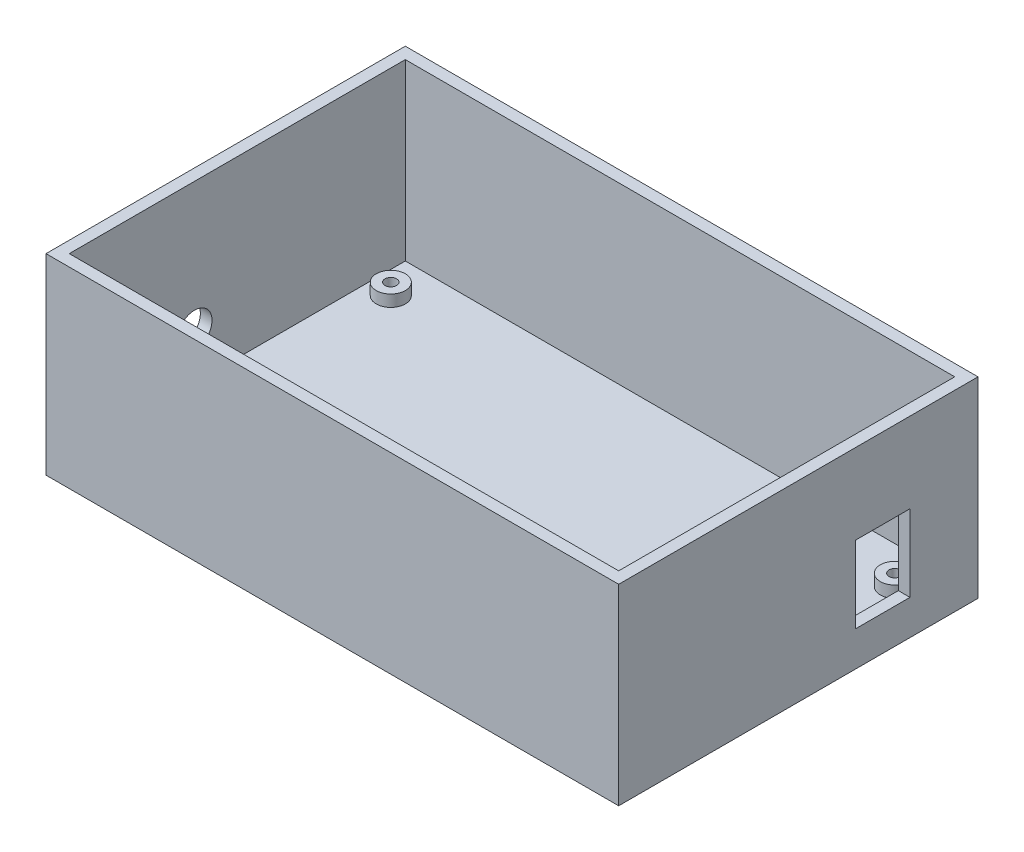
ISO-10303-21;
HEADER;
FILE_DESCRIPTION(('STEP AP214'),'2;1');
FILE_NAME('part.step','',(''),(''),'','','');
FILE_SCHEMA(('AUTOMOTIVE_DESIGN { 1 0 10303 214 1 1 1 1 }'));
ENDSEC;
DATA;
#1=APPLICATION_CONTEXT('core data for automotive mechanical design processes');
#2=APPLICATION_PROTOCOL_DEFINITION('international standard','automotive_design',2000,#1);
#3=PRODUCT_CONTEXT('',#1,'mechanical');
#4=PRODUCT('Part','Part','',(#3));
#5=PRODUCT_RELATED_PRODUCT_CATEGORY('part','',(#4));
#6=PRODUCT_DEFINITION_FORMATION('','',#4);
#7=PRODUCT_DEFINITION_CONTEXT('part definition',#1,'design');
#8=PRODUCT_DEFINITION('design','',#6,#7);
#9=PRODUCT_DEFINITION_SHAPE('','',#8);
#10=(LENGTH_UNIT() NAMED_UNIT(*) SI_UNIT(.MILLI.,.METRE.));
#11=(NAMED_UNIT(*) PLANE_ANGLE_UNIT() SI_UNIT($,.RADIAN.));
#12=(NAMED_UNIT(*) SI_UNIT($,.STERADIAN.) SOLID_ANGLE_UNIT());
#13=UNCERTAINTY_MEASURE_WITH_UNIT(LENGTH_MEASURE(1.E-05),#10,'distance_accuracy_value','');
#14=(GEOMETRIC_REPRESENTATION_CONTEXT(3) GLOBAL_UNCERTAINTY_ASSIGNED_CONTEXT((#13)) GLOBAL_UNIT_ASSIGNED_CONTEXT((#10,
#11,#12)) REPRESENTATION_CONTEXT('',''));
#15=CARTESIAN_POINT('',(0.,0.,0.));
#16=DIRECTION('',(0.,0.,1.));
#17=DIRECTION('',(1.,0.,0.));
#18=AXIS2_PLACEMENT_3D('',#15,#16,#17);
#19=CARTESIAN_POINT('',(0.,-2.,0.));
#20=DIRECTION('',(0.,-1.,0.));
#21=DIRECTION('',(0.,0.,-1.));
#22=AXIS2_PLACEMENT_3D('',#19,#20,#21);
#23=PLANE('',#22);
#24=DIRECTION('',(0.,0.,-1.));
#25=VECTOR('',#24,1.);
#26=CARTESIAN_POINT('',(47.25,-2.,28.85));
#27=LINE('',#26,#25);
#28=CARTESIAN_POINT('',(47.25,-2.,28.85));
#29=VERTEX_POINT('',#28);
#30=CARTESIAN_POINT('',(47.25,-2.,-28.95));
#31=VERTEX_POINT('',#30);
#32=EDGE_CURVE('E167',#29,#31,#27,.T.);
#33=ORIENTED_EDGE('',*,*,#32,.T.);
#34=DIRECTION('',(-1.,0.,0.));
#35=VECTOR('',#34,1.);
#36=CARTESIAN_POINT('',(47.25,-2.,-28.95));
#37=LINE('',#36,#35);
#38=CARTESIAN_POINT('',(-47.25,-2.,-28.95));
#39=VERTEX_POINT('',#38);
#40=EDGE_CURVE('E160',#31,#39,#37,.T.);
#41=ORIENTED_EDGE('',*,*,#40,.T.);
#42=DIRECTION('',(0.,0.,1.));
#43=VECTOR('',#42,1.);
#44=CARTESIAN_POINT('',(-47.25,-2.,-28.95));
#45=LINE('',#44,#43);
#46=CARTESIAN_POINT('',(-47.25,-2.,28.85));
#47=VERTEX_POINT('',#46);
#48=EDGE_CURVE('E177',#39,#47,#45,.T.);
#49=ORIENTED_EDGE('',*,*,#48,.T.);
#50=DIRECTION('',(1.,0.,0.));
#51=VECTOR('',#50,1.);
#52=CARTESIAN_POINT('',(-47.25,-2.,28.85));
#53=LINE('',#52,#51);
#54=EDGE_CURVE('E180',#47,#29,#53,.T.);
#55=ORIENTED_EDGE('',*,*,#54,.T.);
#56=EDGE_LOOP('',(#33,#41,#49,#55));
#57=FACE_BOUND('',#56,.T.);
#58=CARTESIAN_POINT('',(43.35,-2.,-22.55));
#59=DIRECTION('',(0.,-1.,0.));
#60=DIRECTION('',(0.,0.,-1.));
#61=AXIS2_PLACEMENT_3D('',#58,#59,#60);
#62=CIRCLE('',#61,2.5);
#63=CARTESIAN_POINT('',(43.35,-2.,-25.05));
#64=VERTEX_POINT('',#63);
#65=EDGE_CURVE('E11',#64,#64,#62,.F.);
#66=ORIENTED_EDGE('',*,*,#65,.F.);
#67=EDGE_LOOP('',(#66));
#68=FACE_BOUND('',#67,.T.);
#69=CARTESIAN_POINT('',(43.35,-2.,22.55));
#70=DIRECTION('',(0.,-1.,0.));
#71=DIRECTION('',(0.,0.,-1.));
#72=AXIS2_PLACEMENT_3D('',#69,#70,#71);
#73=CIRCLE('',#72,2.5);
#74=CARTESIAN_POINT('',(43.35,-2.,20.05));
#75=VERTEX_POINT('',#74);
#76=EDGE_CURVE('E42',#75,#75,#73,.F.);
#77=ORIENTED_EDGE('',*,*,#76,.F.);
#78=EDGE_LOOP('',(#77));
#79=FACE_BOUND('',#78,.T.);
#80=CARTESIAN_POINT('',(-43.35,-2.,22.55));
#81=DIRECTION('',(0.,-1.,0.));
#82=DIRECTION('',(0.,0.,-1.));
#83=AXIS2_PLACEMENT_3D('',#80,#81,#82);
#84=CIRCLE('',#83,2.5);
#85=CARTESIAN_POINT('',(-43.35,-2.,20.05));
#86=VERTEX_POINT('',#85);
#87=EDGE_CURVE('E240',#86,#86,#84,.F.);
#88=ORIENTED_EDGE('',*,*,#87,.F.);
#89=EDGE_LOOP('',(#88));
#90=FACE_BOUND('',#89,.T.);
#91=CARTESIAN_POINT('',(-43.35,-2.,-22.55));
#92=DIRECTION('',(0.,-1.,0.));
#93=DIRECTION('',(0.,0.,-1.));
#94=AXIS2_PLACEMENT_3D('',#91,#92,#93);
#95=CIRCLE('',#94,2.5);
#96=CARTESIAN_POINT('',(-43.35,-2.,-25.05));
#97=VERTEX_POINT('',#96);
#98=EDGE_CURVE('E232',#97,#97,#95,.F.);
#99=ORIENTED_EDGE('',*,*,#98,.F.);
#100=EDGE_LOOP('',(#99));
#101=FACE_BOUND('',#100,.T.);
#102=ADVANCED_FACE('F34',(#57,#68,#79,#90,#101),#23,.F.);
#103=CARTESIAN_POINT('',(-43.35,0.,-22.55));
#104=DIRECTION('',(0.,-1.,0.));
#105=DIRECTION('',(0.,0.,-1.));
#106=AXIS2_PLACEMENT_3D('',#103,#104,#105);
#107=CYLINDRICAL_SURFACE('',#106,2.5);
#108=CARTESIAN_POINT('',(-43.35,0.,-22.55));
#109=DIRECTION('',(0.,1.,0.));
#110=DIRECTION('',(0.,0.,1.));
#111=AXIS2_PLACEMENT_3D('',#108,#109,#110);
#112=CIRCLE('',#111,2.5);
#113=CARTESIAN_POINT('',(-43.35,0.,-20.05));
#114=VERTEX_POINT('',#113);
#115=EDGE_CURVE('E214',#114,#114,#112,.T.);
#116=ORIENTED_EDGE('',*,*,#115,.F.);
#117=EDGE_LOOP('',(#116));
#118=FACE_BOUND('',#117,.T.);
#119=ORIENTED_EDGE('',*,*,#98,.T.);
#120=EDGE_LOOP('',(#119));
#121=FACE_BOUND('',#120,.T.);
#122=ADVANCED_FACE('F249',(#118,#121),#107,.T.);
#123=CARTESIAN_POINT('',(-43.35,0.,-22.55));
#124=DIRECTION('',(0.,1.,0.));
#125=DIRECTION('',(0.,0.,1.));
#126=AXIS2_PLACEMENT_3D('',#123,#124,#125);
#127=PLANE('',#126);
#128=CARTESIAN_POINT('',(-43.35,0.,-22.55));
#129=DIRECTION('',(0.,1.,0.));
#130=DIRECTION('',(0.,0.,1.));
#131=AXIS2_PLACEMENT_3D('',#128,#129,#130);
#132=CIRCLE('',#131,0.999999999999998);
#133=CARTESIAN_POINT('',(-43.35,0.,-21.55));
#134=VERTEX_POINT('',#133);
#135=EDGE_CURVE('E622',#134,#134,#132,.T.);
#136=ORIENTED_EDGE('',*,*,#135,.F.);
#137=EDGE_LOOP('',(#136));
#138=FACE_BOUND('',#137,.T.);
#139=ORIENTED_EDGE('',*,*,#115,.T.);
#140=EDGE_LOOP('',(#139));
#141=FACE_BOUND('',#140,.T.);
#142=ADVANCED_FACE('F257',(#138,#141),#127,.T.);
#143=CARTESIAN_POINT('',(-43.35,0.,22.55));
#144=DIRECTION('',(0.,-1.,0.));
#145=DIRECTION('',(0.,0.,-1.));
#146=AXIS2_PLACEMENT_3D('',#143,#144,#145);
#147=CYLINDRICAL_SURFACE('',#146,2.5);
#148=CARTESIAN_POINT('',(-43.35,0.,22.55));
#149=DIRECTION('',(0.,1.,0.));
#150=DIRECTION('',(0.,0.,1.));
#151=AXIS2_PLACEMENT_3D('',#148,#149,#150);
#152=CIRCLE('',#151,2.5);
#153=CARTESIAN_POINT('',(-43.35,0.,25.05));
#154=VERTEX_POINT('',#153);
#155=EDGE_CURVE('E211',#154,#154,#152,.T.);
#156=ORIENTED_EDGE('',*,*,#155,.F.);
#157=EDGE_LOOP('',(#156));
#158=FACE_BOUND('',#157,.T.);
#159=ORIENTED_EDGE('',*,*,#87,.T.);
#160=EDGE_LOOP('',(#159));
#161=FACE_BOUND('',#160,.T.);
#162=ADVANCED_FACE('F263',(#158,#161),#147,.T.);
#163=CARTESIAN_POINT('',(-43.35,0.,22.55));
#164=DIRECTION('',(0.,1.,0.));
#165=DIRECTION('',(0.,0.,1.));
#166=AXIS2_PLACEMENT_3D('',#163,#164,#165);
#167=PLANE('',#166);
#168=CARTESIAN_POINT('',(-43.35,0.,22.55));
#169=DIRECTION('',(0.,1.,0.));
#170=DIRECTION('',(0.,0.,1.));
#171=AXIS2_PLACEMENT_3D('',#168,#169,#170);
#172=CIRCLE('',#171,0.999999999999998);
#173=CARTESIAN_POINT('',(-43.35,0.,23.55));
#174=VERTEX_POINT('',#173);
#175=EDGE_CURVE('E616',#174,#174,#172,.T.);
#176=ORIENTED_EDGE('',*,*,#175,.F.);
#177=EDGE_LOOP('',(#176));
#178=FACE_BOUND('',#177,.T.);
#179=ORIENTED_EDGE('',*,*,#155,.T.);
#180=EDGE_LOOP('',(#179));
#181=FACE_BOUND('',#180,.T.);
#182=ADVANCED_FACE('F347',(#178,#181),#167,.T.);
#183=CARTESIAN_POINT('',(43.35,0.,22.55));
#184=DIRECTION('',(0.,-1.,0.));
#185=DIRECTION('',(0.,0.,-1.));
#186=AXIS2_PLACEMENT_3D('',#183,#184,#185);
#187=CYLINDRICAL_SURFACE('',#186,2.5);
#188=CARTESIAN_POINT('',(43.35,0.,22.55));
#189=DIRECTION('',(0.,1.,0.));
#190=DIRECTION('',(0.,0.,1.));
#191=AXIS2_PLACEMENT_3D('',#188,#189,#190);
#192=CIRCLE('',#191,2.5);
#193=CARTESIAN_POINT('',(43.35,0.,25.05));
#194=VERTEX_POINT('',#193);
#195=EDGE_CURVE('E208',#194,#194,#192,.T.);
#196=ORIENTED_EDGE('',*,*,#195,.F.);
#197=EDGE_LOOP('',(#196));
#198=FACE_BOUND('',#197,.T.);
#199=ORIENTED_EDGE('',*,*,#76,.T.);
#200=EDGE_LOOP('',(#199));
#201=FACE_BOUND('',#200,.T.);
#202=ADVANCED_FACE('F245',(#198,#201),#187,.T.);
#203=CARTESIAN_POINT('',(43.35,0.,22.55));
#204=DIRECTION('',(0.,1.,0.));
#205=DIRECTION('',(0.,0.,1.));
#206=AXIS2_PLACEMENT_3D('',#203,#204,#205);
#207=PLANE('',#206);
#208=CARTESIAN_POINT('',(43.35,0.,22.55));
#209=DIRECTION('',(0.,1.,0.));
#210=DIRECTION('',(0.,0.,1.));
#211=AXIS2_PLACEMENT_3D('',#208,#209,#210);
#212=CIRCLE('',#211,0.999999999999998);
#213=CARTESIAN_POINT('',(43.35,0.,23.55));
#214=VERTEX_POINT('',#213);
#215=EDGE_CURVE('E604',#214,#214,#212,.T.);
#216=ORIENTED_EDGE('',*,*,#215,.F.);
#217=EDGE_LOOP('',(#216));
#218=FACE_BOUND('',#217,.T.);
#219=ORIENTED_EDGE('',*,*,#195,.T.);
#220=EDGE_LOOP('',(#219));
#221=FACE_BOUND('',#220,.T.);
#222=ADVANCED_FACE('F340',(#218,#221),#207,.T.);
#223=CARTESIAN_POINT('',(43.35,0.,-22.55));
#224=DIRECTION('',(0.,-1.,0.));
#225=DIRECTION('',(0.,0.,-1.));
#226=AXIS2_PLACEMENT_3D('',#223,#224,#225);
#227=CYLINDRICAL_SURFACE('',#226,2.5);
#228=CARTESIAN_POINT('',(43.35,0.,-22.55));
#229=DIRECTION('',(0.,1.,0.));
#230=DIRECTION('',(0.,0.,1.));
#231=AXIS2_PLACEMENT_3D('',#228,#229,#230);
#232=CIRCLE('',#231,2.5);
#233=CARTESIAN_POINT('',(43.35,0.,-20.05));
#234=VERTEX_POINT('',#233);
#235=EDGE_CURVE('E205',#234,#234,#232,.T.);
#236=ORIENTED_EDGE('',*,*,#235,.F.);
#237=EDGE_LOOP('',(#236));
#238=FACE_BOUND('',#237,.T.);
#239=ORIENTED_EDGE('',*,*,#65,.T.);
#240=EDGE_LOOP('',(#239));
#241=FACE_BOUND('',#240,.T.);
#242=ADVANCED_FACE('F336',(#238,#241),#227,.T.);
#243=CARTESIAN_POINT('',(43.35,0.,-22.55));
#244=DIRECTION('',(0.,1.,0.));
#245=DIRECTION('',(0.,0.,1.));
#246=AXIS2_PLACEMENT_3D('',#243,#244,#245);
#247=PLANE('',#246);
#248=CARTESIAN_POINT('',(43.35,0.,-22.55));
#249=DIRECTION('',(0.,1.,0.));
#250=DIRECTION('',(0.,0.,1.));
#251=AXIS2_PLACEMENT_3D('',#248,#249,#250);
#252=CIRCLE('',#251,0.999999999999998);
#253=CARTESIAN_POINT('',(43.35,0.,-21.55));
#254=VERTEX_POINT('',#253);
#255=EDGE_CURVE('E147',#254,#254,#252,.T.);
#256=ORIENTED_EDGE('',*,*,#255,.F.);
#257=EDGE_LOOP('',(#256));
#258=FACE_BOUND('',#257,.T.);
#259=ORIENTED_EDGE('',*,*,#235,.T.);
#260=EDGE_LOOP('',(#259));
#261=FACE_BOUND('',#260,.T.);
#262=ADVANCED_FACE('F302',(#258,#261),#247,.T.);
#263=CARTESIAN_POINT('',(0.,28.,0.));
#264=DIRECTION('',(0.,1.,0.));
#265=DIRECTION('',(0.,0.,1.));
#266=AXIS2_PLACEMENT_3D('',#263,#264,#265);
#267=PLANE('',#266);
#268=DIRECTION('',(1.,0.,0.));
#269=VECTOR('',#268,1.);
#270=CARTESIAN_POINT('',(-49.25,28.,30.85));
#271=LINE('',#270,#269);
#272=CARTESIAN_POINT('',(-49.25,28.,30.85));
#273=VERTEX_POINT('',#272);
#274=CARTESIAN_POINT('',(49.25,28.,30.85));
#275=VERTEX_POINT('',#274);
#276=EDGE_CURVE('E193',#273,#275,#271,.T.);
#277=ORIENTED_EDGE('',*,*,#276,.T.);
#278=DIRECTION('',(0.,0.,-1.));
#279=VECTOR('',#278,1.);
#280=CARTESIAN_POINT('',(49.25,28.,30.85));
#281=LINE('',#280,#279);
#282=CARTESIAN_POINT('',(49.25,28.,-30.95));
#283=VERTEX_POINT('',#282);
#284=EDGE_CURVE('E196',#275,#283,#281,.T.);
#285=ORIENTED_EDGE('',*,*,#284,.T.);
#286=DIRECTION('',(-1.,0.,0.));
#287=VECTOR('',#286,1.);
#288=CARTESIAN_POINT('',(49.25,28.,-30.95));
#289=LINE('',#288,#287);
#290=CARTESIAN_POINT('',(-49.25,28.,-30.95));
#291=VERTEX_POINT('',#290);
#292=EDGE_CURVE('E199',#283,#291,#289,.T.);
#293=ORIENTED_EDGE('',*,*,#292,.T.);
#294=DIRECTION('',(0.,0.,1.));
#295=VECTOR('',#294,1.);
#296=CARTESIAN_POINT('',(-49.25,28.,-30.95));
#297=LINE('',#296,#295);
#298=EDGE_CURVE('E202',#291,#273,#297,.T.);
#299=ORIENTED_EDGE('',*,*,#298,.T.);
#300=EDGE_LOOP('',(#277,#285,#293,#299));
#301=FACE_BOUND('',#300,.T.);
#302=DIRECTION('',(0.,0.,1.));
#303=VECTOR('',#302,1.);
#304=CARTESIAN_POINT('',(-47.25,28.,-28.95));
#305=LINE('',#304,#303);
#306=CARTESIAN_POINT('',(-47.25,28.,-28.95));
#307=VERTEX_POINT('',#306);
#308=CARTESIAN_POINT('',(-47.25,28.,28.85));
#309=VERTEX_POINT('',#308);
#310=EDGE_CURVE('E166',#307,#309,#305,.T.);
#311=ORIENTED_EDGE('',*,*,#310,.F.);
#312=DIRECTION('',(-1.,0.,0.));
#313=VECTOR('',#312,1.);
#314=CARTESIAN_POINT('',(47.25,28.,-28.95));
#315=LINE('',#314,#313);
#316=CARTESIAN_POINT('',(47.25,28.,-28.95));
#317=VERTEX_POINT('',#316);
#318=EDGE_CURVE('E164',#317,#307,#315,.T.);
#319=ORIENTED_EDGE('',*,*,#318,.F.);
#320=DIRECTION('',(0.,0.,-1.));
#321=VECTOR('',#320,1.);
#322=CARTESIAN_POINT('',(47.25,28.,28.85));
#323=LINE('',#322,#321);
#324=CARTESIAN_POINT('',(47.25,28.,28.85));
#325=VERTEX_POINT('',#324);
#326=EDGE_CURVE('E172',#325,#317,#323,.T.);
#327=ORIENTED_EDGE('',*,*,#326,.F.);
#328=DIRECTION('',(1.,0.,0.));
#329=VECTOR('',#328,1.);
#330=CARTESIAN_POINT('',(-47.25,28.,28.85));
#331=LINE('',#330,#329);
#332=EDGE_CURVE('E169',#309,#325,#331,.T.);
#333=ORIENTED_EDGE('',*,*,#332,.F.);
#334=EDGE_LOOP('',(#311,#319,#327,#333));
#335=FACE_BOUND('',#334,.T.);
#336=ADVANCED_FACE('F296',(#301,#335),#267,.T.);
#337=CARTESIAN_POINT('',(47.25,28.,-28.95));
#338=DIRECTION('',(0.,0.,1.));
#339=DIRECTION('',(1.,0.,0.));
#340=AXIS2_PLACEMENT_3D('',#337,#338,#339);
#341=PLANE('',#340);
#342=ORIENTED_EDGE('',*,*,#40,.F.);
#343=DIRECTION('',(0.,-1.,0.));
#344=VECTOR('',#343,1.);
#345=CARTESIAN_POINT('',(47.25,28.,-28.95));
#346=LINE('',#345,#344);
#347=EDGE_CURVE('E174',#317,#31,#346,.T.);
#348=ORIENTED_EDGE('',*,*,#347,.F.);
#349=ORIENTED_EDGE('',*,*,#318,.T.);
#350=DIRECTION('',(0.,-1.,0.));
#351=VECTOR('',#350,1.);
#352=CARTESIAN_POINT('',(-47.25,28.,-28.95));
#353=LINE('',#352,#351);
#354=EDGE_CURVE('E190',#307,#39,#353,.T.);
#355=ORIENTED_EDGE('',*,*,#354,.T.);
#356=EDGE_LOOP('',(#342,#348,#349,#355));
#357=FACE_BOUND('',#356,.T.);
#358=ADVANCED_FACE('F301',(#357),#341,.T.);
#359=CARTESIAN_POINT('',(-47.25,28.,-28.95));
#360=DIRECTION('',(1.,0.,0.));
#361=DIRECTION('',(0.,0.,-1.));
#362=AXIS2_PLACEMENT_3D('',#359,#360,#361);
#363=PLANE('',#362);
#364=CARTESIAN_POINT('',(-47.25,5.8,7.29999999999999));
#365=DIRECTION('',(1.,0.,0.));
#366=DIRECTION('',(0.,0.,-1.));
#367=AXIS2_PLACEMENT_3D('',#364,#365,#366);
#368=CIRCLE('',#367,3.);
#369=CARTESIAN_POINT('',(-47.25,5.8,4.29999999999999));
#370=VERTEX_POINT('',#369);
#371=EDGE_CURVE('E611',#370,#370,#368,.T.);
#372=ORIENTED_EDGE('',*,*,#371,.F.);
#373=EDGE_LOOP('',(#372));
#374=FACE_BOUND('',#373,.T.);
#375=ORIENTED_EDGE('',*,*,#48,.F.);
#376=ORIENTED_EDGE('',*,*,#354,.F.);
#377=ORIENTED_EDGE('',*,*,#310,.T.);
#378=DIRECTION('',(0.,-1.,0.));
#379=VECTOR('',#378,1.);
#380=CARTESIAN_POINT('',(-47.25,28.,28.85));
#381=LINE('',#380,#379);
#382=EDGE_CURVE('E188',#309,#47,#381,.T.);
#383=ORIENTED_EDGE('',*,*,#382,.T.);
#384=EDGE_LOOP('',(#375,#376,#377,#383));
#385=FACE_BOUND('',#384,.T.);
#386=ADVANCED_FACE('F311',(#374,#385),#363,.T.);
#387=CARTESIAN_POINT('',(-47.25,28.,28.85));
#388=DIRECTION('',(0.,0.,-1.));
#389=DIRECTION('',(-1.,0.,0.));
#390=AXIS2_PLACEMENT_3D('',#387,#388,#389);
#391=PLANE('',#390);
#392=ORIENTED_EDGE('',*,*,#54,.F.);
#393=ORIENTED_EDGE('',*,*,#382,.F.);
#394=ORIENTED_EDGE('',*,*,#332,.T.);
#395=DIRECTION('',(0.,-1.,0.));
#396=VECTOR('',#395,1.);
#397=CARTESIAN_POINT('',(47.25,28.,28.85));
#398=LINE('',#397,#396);
#399=EDGE_CURVE('E186',#325,#29,#398,.T.);
#400=ORIENTED_EDGE('',*,*,#399,.T.);
#401=EDGE_LOOP('',(#392,#393,#394,#400));
#402=FACE_BOUND('',#401,.T.);
#403=ADVANCED_FACE('F314',(#402),#391,.T.);
#404=CARTESIAN_POINT('',(47.25,28.,28.85));
#405=DIRECTION('',(-1.,0.,0.));
#406=DIRECTION('',(0.,0.,1.));
#407=AXIS2_PLACEMENT_3D('',#404,#405,#406);
#408=PLANE('',#407);
#409=DIRECTION('',(0.,1.,0.));
#410=VECTOR('',#409,1.);
#411=CARTESIAN_POINT('',(47.25,1.,-19.25));
#412=LINE('',#411,#410);
#413=CARTESIAN_POINT('',(47.25,1.,-19.25));
#414=VERTEX_POINT('',#413);
#415=CARTESIAN_POINT('',(47.25,14.2,-19.25));
#416=VERTEX_POINT('',#415);
#417=EDGE_CURVE('E125',#414,#416,#412,.T.);
#418=ORIENTED_EDGE('',*,*,#417,.T.);
#419=DIRECTION('',(0.,0.,1.));
#420=VECTOR('',#419,1.);
#421=CARTESIAN_POINT('',(47.25,14.2,-9.85));
#422=LINE('',#421,#420);
#423=CARTESIAN_POINT('',(47.25,14.2,-9.85));
#424=VERTEX_POINT('',#423);
#425=EDGE_CURVE('E134',#416,#424,#422,.T.);
#426=ORIENTED_EDGE('',*,*,#425,.T.);
#427=DIRECTION('',(0.,-1.,0.));
#428=VECTOR('',#427,1.);
#429=CARTESIAN_POINT('',(47.25,1.,-9.85));
#430=LINE('',#429,#428);
#431=CARTESIAN_POINT('',(47.25,1.,-9.85));
#432=VERTEX_POINT('',#431);
#433=EDGE_CURVE('E49',#424,#432,#430,.T.);
#434=ORIENTED_EDGE('',*,*,#433,.T.);
#435=DIRECTION('',(0.,0.,-1.));
#436=VECTOR('',#435,1.);
#437=CARTESIAN_POINT('',(47.25,1.,-9.85));
#438=LINE('',#437,#436);
#439=EDGE_CURVE('E131',#432,#414,#438,.T.);
#440=ORIENTED_EDGE('',*,*,#439,.T.);
#441=EDGE_LOOP('',(#418,#426,#434,#440));
#442=FACE_BOUND('',#441,.T.);
#443=ORIENTED_EDGE('',*,*,#32,.F.);
#444=ORIENTED_EDGE('',*,*,#399,.F.);
#445=ORIENTED_EDGE('',*,*,#326,.T.);
#446=ORIENTED_EDGE('',*,*,#347,.T.);
#447=EDGE_LOOP('',(#443,#444,#445,#446));
#448=FACE_BOUND('',#447,.T.);
#449=ADVANCED_FACE('F138',(#442,#448),#408,.T.);
#450=CARTESIAN_POINT('',(0.,-5.,0.));
#451=DIRECTION('',(0.,-1.,0.));
#452=DIRECTION('',(0.,0.,-1.));
#453=AXIS2_PLACEMENT_3D('',#450,#451,#452);
#454=PLANE('',#453);
#455=DIRECTION('',(0.,0.,-1.));
#456=VECTOR('',#455,1.);
#457=CARTESIAN_POINT('',(-49.25,-5.,30.85));
#458=LINE('',#457,#456);
#459=CARTESIAN_POINT('',(-49.25,-5.,30.85));
#460=VERTEX_POINT('',#459);
#461=CARTESIAN_POINT('',(-49.25,-5.,-30.95));
#462=VERTEX_POINT('',#461);
#463=EDGE_CURVE('E217',#460,#462,#458,.T.);
#464=ORIENTED_EDGE('',*,*,#463,.T.);
#465=DIRECTION('',(1.,0.,0.));
#466=VECTOR('',#465,1.);
#467=CARTESIAN_POINT('',(-49.25,-5.,-30.95));
#468=LINE('',#467,#466);
#469=CARTESIAN_POINT('',(49.25,-5.,-30.95));
#470=VERTEX_POINT('',#469);
#471=EDGE_CURVE('E220',#462,#470,#468,.T.);
#472=ORIENTED_EDGE('',*,*,#471,.T.);
#473=DIRECTION('',(0.,0.,1.));
#474=VECTOR('',#473,1.);
#475=CARTESIAN_POINT('',(49.25,-5.,30.85));
#476=LINE('',#475,#474);
#477=CARTESIAN_POINT('',(49.25,-5.,30.85));
#478=VERTEX_POINT('',#477);
#479=EDGE_CURVE('E223',#470,#478,#476,.T.);
#480=ORIENTED_EDGE('',*,*,#479,.T.);
#481=DIRECTION('',(-1.,0.,0.));
#482=VECTOR('',#481,1.);
#483=CARTESIAN_POINT('',(-49.25,-5.,30.85));
#484=LINE('',#483,#482);
#485=EDGE_CURVE('E226',#478,#460,#484,.T.);
#486=ORIENTED_EDGE('',*,*,#485,.T.);
#487=EDGE_LOOP('',(#464,#472,#480,#486));
#488=FACE_BOUND('',#487,.T.);
#489=ADVANCED_FACE('F269',(#488),#454,.T.);
#490=CARTESIAN_POINT('',(-49.25,-2.,30.85));
#491=DIRECTION('',(-1.,0.,0.));
#492=DIRECTION('',(0.,0.,1.));
#493=AXIS2_PLACEMENT_3D('',#490,#491,#492);
#494=PLANE('',#493);
#495=CARTESIAN_POINT('',(-49.25,5.8,7.29999999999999));
#496=DIRECTION('',(-1.,0.,0.));
#497=DIRECTION('',(0.,0.,1.));
#498=AXIS2_PLACEMENT_3D('',#495,#496,#497);
#499=CIRCLE('',#498,3.);
#500=CARTESIAN_POINT('',(-49.25,5.8,10.3));
#501=VERTEX_POINT('',#500);
#502=EDGE_CURVE('E627',#501,#501,#499,.T.);
#503=ORIENTED_EDGE('',*,*,#502,.F.);
#504=EDGE_LOOP('',(#503));
#505=FACE_BOUND('',#504,.T.);
#506=ORIENTED_EDGE('',*,*,#463,.F.);
#507=DIRECTION('',(0.,-1.,0.));
#508=VECTOR('',#507,1.);
#509=CARTESIAN_POINT('',(-49.25,-2.,30.85));
#510=LINE('',#509,#508);
#511=EDGE_CURVE('E230',#273,#460,#510,.T.);
#512=ORIENTED_EDGE('',*,*,#511,.F.);
#513=ORIENTED_EDGE('',*,*,#298,.F.);
#514=DIRECTION('',(0.,-1.,0.));
#515=VECTOR('',#514,1.);
#516=CARTESIAN_POINT('',(-49.25,-2.,-30.95));
#517=LINE('',#516,#515);
#518=EDGE_CURVE('E229',#291,#462,#517,.T.);
#519=ORIENTED_EDGE('',*,*,#518,.T.);
#520=EDGE_LOOP('',(#506,#512,#513,#519));
#521=FACE_BOUND('',#520,.T.);
#522=ADVANCED_FACE('F36',(#505,#521),#494,.T.);
#523=CARTESIAN_POINT('',(-49.25,-2.,-30.95));
#524=DIRECTION('',(0.,0.,-1.));
#525=DIRECTION('',(-1.,0.,0.));
#526=AXIS2_PLACEMENT_3D('',#523,#524,#525);
#527=PLANE('',#526);
#528=ORIENTED_EDGE('',*,*,#471,.F.);
#529=ORIENTED_EDGE('',*,*,#518,.F.);
#530=ORIENTED_EDGE('',*,*,#292,.F.);
#531=DIRECTION('',(0.,-1.,0.));
#532=VECTOR('',#531,1.);
#533=CARTESIAN_POINT('',(49.25,-2.,-30.95));
#534=LINE('',#533,#532);
#535=EDGE_CURVE('E235',#283,#470,#534,.T.);
#536=ORIENTED_EDGE('',*,*,#535,.T.);
#537=EDGE_LOOP('',(#528,#529,#530,#536));
#538=FACE_BOUND('',#537,.T.);
#539=ADVANCED_FACE('F279',(#538),#527,.T.);
#540=CARTESIAN_POINT('',(49.25,-2.,30.85));
#541=DIRECTION('',(1.,0.,0.));
#542=DIRECTION('',(0.,0.,-1.));
#543=AXIS2_PLACEMENT_3D('',#540,#541,#542);
#544=PLANE('',#543);
#545=DIRECTION('',(0.,1.,0.));
#546=VECTOR('',#545,1.);
#547=CARTESIAN_POINT('',(49.25,1.,-19.25));
#548=LINE('',#547,#546);
#549=CARTESIAN_POINT('',(49.25,1.,-19.25));
#550=VERTEX_POINT('',#549);
#551=CARTESIAN_POINT('',(49.25,14.2,-19.25));
#552=VERTEX_POINT('',#551);
#553=EDGE_CURVE('E57',#550,#552,#548,.T.);
#554=ORIENTED_EDGE('',*,*,#553,.F.);
#555=DIRECTION('',(0.,0.,-1.));
#556=VECTOR('',#555,1.);
#557=CARTESIAN_POINT('',(49.25,1.,-9.85));
#558=LINE('',#557,#556);
#559=CARTESIAN_POINT('',(49.25,1.,-9.85));
#560=VERTEX_POINT('',#559);
#561=EDGE_CURVE('E141',#560,#550,#558,.T.);
#562=ORIENTED_EDGE('',*,*,#561,.F.);
#563=DIRECTION('',(0.,-1.,0.));
#564=VECTOR('',#563,1.);
#565=CARTESIAN_POINT('',(49.25,1.,-9.85));
#566=LINE('',#565,#564);
#567=CARTESIAN_POINT('',(49.25,14.2,-9.85));
#568=VERTEX_POINT('',#567);
#569=EDGE_CURVE('E144',#568,#560,#566,.T.);
#570=ORIENTED_EDGE('',*,*,#569,.F.);
#571=DIRECTION('',(0.,0.,1.));
#572=VECTOR('',#571,1.);
#573=CARTESIAN_POINT('',(49.25,14.2,-9.85));
#574=LINE('',#573,#572);
#575=EDGE_CURVE('E153',#552,#568,#574,.T.);
#576=ORIENTED_EDGE('',*,*,#575,.F.);
#577=EDGE_LOOP('',(#554,#562,#570,#576));
#578=FACE_BOUND('',#577,.T.);
#579=ORIENTED_EDGE('',*,*,#479,.F.);
#580=ORIENTED_EDGE('',*,*,#535,.F.);
#581=ORIENTED_EDGE('',*,*,#284,.F.);
#582=DIRECTION('',(0.,-1.,0.));
#583=VECTOR('',#582,1.);
#584=CARTESIAN_POINT('',(49.25,-2.,30.85));
#585=LINE('',#584,#583);
#586=EDGE_CURVE('E233',#275,#478,#585,.T.);
#587=ORIENTED_EDGE('',*,*,#586,.T.);
#588=EDGE_LOOP('',(#579,#580,#581,#587));
#589=FACE_BOUND('',#588,.T.);
#590=ADVANCED_FACE('F276',(#578,#589),#544,.T.);
#591=CARTESIAN_POINT('',(-49.25,-2.,30.85));
#592=DIRECTION('',(0.,0.,1.));
#593=DIRECTION('',(1.,0.,0.));
#594=AXIS2_PLACEMENT_3D('',#591,#592,#593);
#595=PLANE('',#594);
#596=ORIENTED_EDGE('',*,*,#485,.F.);
#597=ORIENTED_EDGE('',*,*,#586,.F.);
#598=ORIENTED_EDGE('',*,*,#276,.F.);
#599=ORIENTED_EDGE('',*,*,#511,.T.);
#600=EDGE_LOOP('',(#596,#597,#598,#599));
#601=FACE_BOUND('',#600,.T.);
#602=ADVANCED_FACE('F273',(#601),#595,.T.);
#603=CARTESIAN_POINT('',(47.25,1.,-19.25));
#604=DIRECTION('',(0.,0.,-1.));
#605=DIRECTION('',(-1.,0.,0.));
#606=AXIS2_PLACEMENT_3D('',#603,#604,#605);
#607=PLANE('',#606);
#608=ORIENTED_EDGE('',*,*,#553,.T.);
#609=DIRECTION('',(1.,0.,0.));
#610=VECTOR('',#609,1.);
#611=CARTESIAN_POINT('',(47.25,14.2,-19.25));
#612=LINE('',#611,#610);
#613=EDGE_CURVE('E121',#416,#552,#612,.T.);
#614=ORIENTED_EDGE('',*,*,#613,.F.);
#615=ORIENTED_EDGE('',*,*,#417,.F.);
#616=DIRECTION('',(1.,0.,0.));
#617=VECTOR('',#616,1.);
#618=CARTESIAN_POINT('',(47.25,1.,-19.25));
#619=LINE('',#618,#617);
#620=EDGE_CURVE('E158',#414,#550,#619,.T.);
#621=ORIENTED_EDGE('',*,*,#620,.T.);
#622=EDGE_LOOP('',(#608,#614,#615,#621));
#623=FACE_BOUND('',#622,.T.);
#624=ADVANCED_FACE('F123',(#623),#607,.F.);
#625=CARTESIAN_POINT('',(47.25,1.,-9.85));
#626=DIRECTION('',(0.,-1.,0.));
#627=DIRECTION('',(0.,0.,-1.));
#628=AXIS2_PLACEMENT_3D('',#625,#626,#627);
#629=PLANE('',#628);
#630=ORIENTED_EDGE('',*,*,#561,.T.);
#631=ORIENTED_EDGE('',*,*,#620,.F.);
#632=ORIENTED_EDGE('',*,*,#439,.F.);
#633=DIRECTION('',(1.,0.,0.));
#634=VECTOR('',#633,1.);
#635=CARTESIAN_POINT('',(47.25,1.,-9.85));
#636=LINE('',#635,#634);
#637=EDGE_CURVE('E161',#432,#560,#636,.T.);
#638=ORIENTED_EDGE('',*,*,#637,.T.);
#639=EDGE_LOOP('',(#630,#631,#632,#638));
#640=FACE_BOUND('',#639,.T.);
#641=ADVANCED_FACE('F433',(#640),#629,.F.);
#642=CARTESIAN_POINT('',(47.25,1.,-9.85));
#643=DIRECTION('',(0.,0.,1.));
#644=DIRECTION('',(1.,0.,0.));
#645=AXIS2_PLACEMENT_3D('',#642,#643,#644);
#646=PLANE('',#645);
#647=ORIENTED_EDGE('',*,*,#569,.T.);
#648=ORIENTED_EDGE('',*,*,#637,.F.);
#649=ORIENTED_EDGE('',*,*,#433,.F.);
#650=DIRECTION('',(1.,0.,0.));
#651=VECTOR('',#650,1.);
#652=CARTESIAN_POINT('',(47.25,14.2,-9.85));
#653=LINE('',#652,#651);
#654=EDGE_CURVE('E130',#424,#568,#653,.T.);
#655=ORIENTED_EDGE('',*,*,#654,.T.);
#656=EDGE_LOOP('',(#647,#648,#649,#655));
#657=FACE_BOUND('',#656,.T.);
#658=ADVANCED_FACE('F441',(#657),#646,.F.);
#659=CARTESIAN_POINT('',(47.25,14.2,-9.85));
#660=DIRECTION('',(0.,1.,0.));
#661=DIRECTION('',(0.,0.,1.));
#662=AXIS2_PLACEMENT_3D('',#659,#660,#661);
#663=PLANE('',#662);
#664=ORIENTED_EDGE('',*,*,#575,.T.);
#665=ORIENTED_EDGE('',*,*,#654,.F.);
#666=ORIENTED_EDGE('',*,*,#425,.F.);
#667=ORIENTED_EDGE('',*,*,#613,.T.);
#668=EDGE_LOOP('',(#664,#665,#666,#667));
#669=FACE_BOUND('',#668,.T.);
#670=ADVANCED_FACE('F135',(#669),#663,.F.);
#671=CARTESIAN_POINT('',(43.35,-3.,-22.55));
#672=DIRECTION('',(0.,1.,0.));
#673=DIRECTION('',(0.,0.,1.));
#674=AXIS2_PLACEMENT_3D('',#671,#672,#673);
#675=CYLINDRICAL_SURFACE('',#674,0.999999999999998);
#676=CARTESIAN_POINT('',(43.35,-3.,-22.55));
#677=DIRECTION('',(0.,1.,0.));
#678=DIRECTION('',(0.,0.,1.));
#679=AXIS2_PLACEMENT_3D('',#676,#677,#678);
#680=CIRCLE('',#679,0.999999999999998);
#681=CARTESIAN_POINT('',(43.35,-3.,-21.55));
#682=VERTEX_POINT('',#681);
#683=EDGE_CURVE('E154',#682,#682,#680,.T.);
#684=ORIENTED_EDGE('',*,*,#683,.F.);
#685=EDGE_LOOP('',(#684));
#686=FACE_BOUND('',#685,.T.);
#687=ORIENTED_EDGE('',*,*,#255,.T.);
#688=EDGE_LOOP('',(#687));
#689=FACE_BOUND('',#688,.T.);
#690=ADVANCED_FACE('F458',(#686,#689),#675,.F.);
#691=CARTESIAN_POINT('',(43.35,-3.,-22.55));
#692=DIRECTION('',(0.,1.,0.));
#693=DIRECTION('',(0.,0.,1.));
#694=AXIS2_PLACEMENT_3D('',#691,#692,#693);
#695=PLANE('',#694);
#696=ORIENTED_EDGE('',*,*,#683,.T.);
#697=EDGE_LOOP('',(#696));
#698=FACE_BOUND('',#697,.T.);
#699=ADVANCED_FACE('F566',(#698),#695,.T.);
#700=CARTESIAN_POINT('',(43.35,-3.,22.55));
#701=DIRECTION('',(0.,1.,0.));
#702=DIRECTION('',(0.,0.,1.));
#703=AXIS2_PLACEMENT_3D('',#700,#701,#702);
#704=CYLINDRICAL_SURFACE('',#703,0.999999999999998);
#705=CARTESIAN_POINT('',(43.35,-3.,22.55));
#706=DIRECTION('',(0.,1.,0.));
#707=DIRECTION('',(0.,0.,1.));
#708=AXIS2_PLACEMENT_3D('',#705,#706,#707);
#709=CIRCLE('',#708,0.999999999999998);
#710=CARTESIAN_POINT('',(43.35,-3.,23.55));
#711=VERTEX_POINT('',#710);
#712=EDGE_CURVE('E602',#711,#711,#709,.T.);
#713=ORIENTED_EDGE('',*,*,#712,.F.);
#714=EDGE_LOOP('',(#713));
#715=FACE_BOUND('',#714,.T.);
#716=ORIENTED_EDGE('',*,*,#215,.T.);
#717=EDGE_LOOP('',(#716));
#718=FACE_BOUND('',#717,.T.);
#719=ADVANCED_FACE('F558',(#715,#718),#704,.F.);
#720=CARTESIAN_POINT('',(43.35,-3.,22.55));
#721=DIRECTION('',(0.,1.,0.));
#722=DIRECTION('',(0.,0.,1.));
#723=AXIS2_PLACEMENT_3D('',#720,#721,#722);
#724=PLANE('',#723);
#725=ORIENTED_EDGE('',*,*,#712,.T.);
#726=EDGE_LOOP('',(#725));
#727=FACE_BOUND('',#726,.T.);
#728=ADVANCED_FACE('F550',(#727),#724,.T.);
#729=CARTESIAN_POINT('',(-43.35,-3.,22.55));
#730=DIRECTION('',(0.,1.,0.));
#731=DIRECTION('',(0.,0.,1.));
#732=AXIS2_PLACEMENT_3D('',#729,#730,#731);
#733=CYLINDRICAL_SURFACE('',#732,0.999999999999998);
#734=CARTESIAN_POINT('',(-43.35,-3.,22.55));
#735=DIRECTION('',(0.,1.,0.));
#736=DIRECTION('',(0.,0.,1.));
#737=AXIS2_PLACEMENT_3D('',#734,#735,#736);
#738=CIRCLE('',#737,0.999999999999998);
#739=CARTESIAN_POINT('',(-43.35,-3.,23.55));
#740=VERTEX_POINT('',#739);
#741=EDGE_CURVE('E608',#740,#740,#738,.T.);
#742=ORIENTED_EDGE('',*,*,#741,.F.);
#743=EDGE_LOOP('',(#742));
#744=FACE_BOUND('',#743,.T.);
#745=ORIENTED_EDGE('',*,*,#175,.T.);
#746=EDGE_LOOP('',(#745));
#747=FACE_BOUND('',#746,.T.);
#748=ADVANCED_FACE('F542',(#744,#747),#733,.F.);
#749=CARTESIAN_POINT('',(-43.35,-3.,22.55));
#750=DIRECTION('',(0.,1.,0.));
#751=DIRECTION('',(0.,0.,1.));
#752=AXIS2_PLACEMENT_3D('',#749,#750,#751);
#753=PLANE('',#752);
#754=ORIENTED_EDGE('',*,*,#741,.T.);
#755=EDGE_LOOP('',(#754));
#756=FACE_BOUND('',#755,.T.);
#757=ADVANCED_FACE('F534',(#756),#753,.T.);
#758=CARTESIAN_POINT('',(-43.35,-3.,-22.55));
#759=DIRECTION('',(0.,1.,0.));
#760=DIRECTION('',(0.,0.,1.));
#761=AXIS2_PLACEMENT_3D('',#758,#759,#760);
#762=CYLINDRICAL_SURFACE('',#761,0.999999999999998);
#763=CARTESIAN_POINT('',(-43.35,-3.,-22.55));
#764=DIRECTION('',(0.,1.,0.));
#765=DIRECTION('',(0.,0.,1.));
#766=AXIS2_PLACEMENT_3D('',#763,#764,#765);
#767=CIRCLE('',#766,0.999999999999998);
#768=CARTESIAN_POINT('',(-43.35,-3.,-21.55));
#769=VERTEX_POINT('',#768);
#770=EDGE_CURVE('E619',#769,#769,#767,.T.);
#771=ORIENTED_EDGE('',*,*,#770,.F.);
#772=EDGE_LOOP('',(#771));
#773=FACE_BOUND('',#772,.T.);
#774=ORIENTED_EDGE('',*,*,#135,.T.);
#775=EDGE_LOOP('',(#774));
#776=FACE_BOUND('',#775,.T.);
#777=ADVANCED_FACE('F527',(#773,#776),#762,.F.);
#778=CARTESIAN_POINT('',(-43.35,-3.,-22.55));
#779=DIRECTION('',(0.,1.,0.));
#780=DIRECTION('',(0.,0.,1.));
#781=AXIS2_PLACEMENT_3D('',#778,#779,#780);
#782=PLANE('',#781);
#783=ORIENTED_EDGE('',*,*,#770,.T.);
#784=EDGE_LOOP('',(#783));
#785=FACE_BOUND('',#784,.T.);
#786=ADVANCED_FACE('F517',(#785),#782,.T.);
#787=CARTESIAN_POINT('',(-42.65,5.8,7.29999999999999));
#788=DIRECTION('',(-1.,0.,0.));
#789=DIRECTION('',(0.,0.,1.));
#790=AXIS2_PLACEMENT_3D('',#787,#788,#789);
#791=CYLINDRICAL_SURFACE('',#790,3.);
#792=ORIENTED_EDGE('',*,*,#371,.T.);
#793=EDGE_LOOP('',(#792));
#794=FACE_BOUND('',#793,.T.);
#795=ORIENTED_EDGE('',*,*,#502,.T.);
#796=EDGE_LOOP('',(#795));
#797=FACE_BOUND('',#796,.T.);
#798=ADVANCED_FACE('F513',(#794,#797),#791,.F.);
#799=CLOSED_SHELL('',(#102,#122,#142,#162,#182,#202,#222,#242,#262,#336,#358,#386,#403,#449,
#489,#522,#539,#590,#602,#624,#641,#658,#670,#690,#699,#719,#728,#748,#757,#777,#786,#798));
#800=MANIFOLD_SOLID_BREP('B2',#799);
#801=ADVANCED_BREP_SHAPE_REPRESENTATION('',(#18,#800),#14);
#802=SHAPE_DEFINITION_REPRESENTATION(#9,#801);
ENDSEC;
END-ISO-10303-21;
